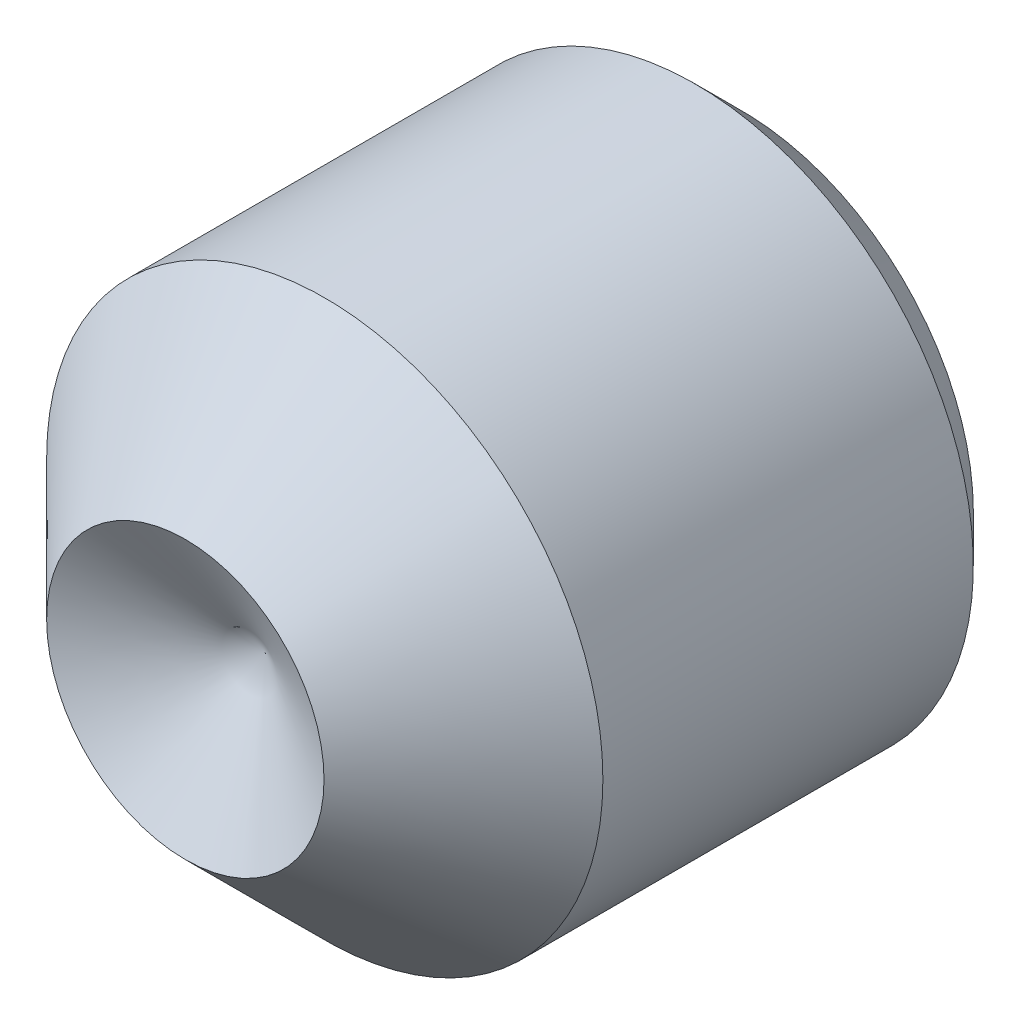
from build123d import *

# Parameters (mm, degrees)
CUT_EXTRUDE1_DEPTH = 2.5


with BuildPart() as part:
    # Logo3_bib1 → Revolve1 (revolve)
    with BuildSketch(Plane(origin=(0, 0, 0), x_dir=(-1, 0, 0), z_dir=(0, -1, 0))):
        Polygon((0, -9.525), (0, 0), (3.96875, 0), (4.7625, -0.79375), (4.7625, -8.73125), (3.96875, -9.525), align=None)
    revolve(axis=Axis((0, 0, -10.585154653), (0, 0, 1)))

    # Logo3_bib11 → Cut-Extrude1 (cut)
    with BuildSketch(Plane(origin=(0, 0, 0), x_dir=(1, 0, 0), z_dir=(0, 0, -1))):
        Polygon((2.749630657, 0), (1.374815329, 2.38125), (-1.374815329, 2.38125), (-2.749630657, 0), (-1.374815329, -2.38125), (1.374815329, -2.38125), align=None)
    extrude(amount=-CUT_EXTRUDE1_DEPTH, mode=Mode.SUBTRACT)

    # Logo3_bib3 → Type3 (revolve, cut)
    with BuildSketch(Plane(origin=(0, 0, 0), x_dir=(1, 0, 0), z_dir=(0, 1, 0)), mode=Mode.PRIVATE) as type3_sk:
        Polygon((-2.3749, -9.525), (-4.7625, -7.1374), (-5.7625, -7.1374), (-5.7625, -10.525), (0, -10.525), (0, -8.153850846), align=None)
    revolve(type3_sk.sketch.rotate(Axis((0, 0, 43.517168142), (0, 0, -1)), 180), axis=Axis((0, 0, 43.517168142), (0, 0, -1)), mode=Mode.SUBTRACT)


solid = part.part
